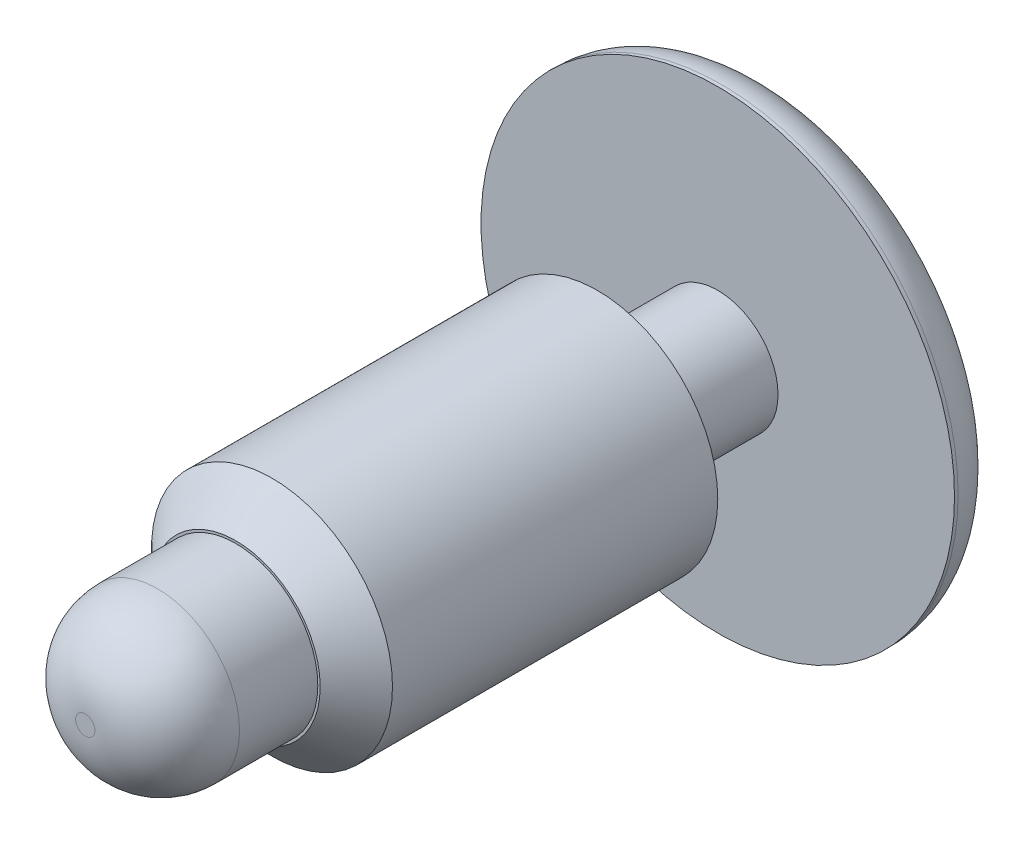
ISO-10303-21;
HEADER;
FILE_DESCRIPTION(('STEP AP214'),'2;1');
FILE_NAME('part.step','',(''),(''),'','','');
FILE_SCHEMA(('AUTOMOTIVE_DESIGN { 1 0 10303 214 1 1 1 1 }'));
ENDSEC;
DATA;
#1=APPLICATION_CONTEXT('core data for automotive mechanical design processes');
#2=APPLICATION_PROTOCOL_DEFINITION('international standard','automotive_design',2000,#1);
#3=PRODUCT_CONTEXT('',#1,'mechanical');
#4=PRODUCT('Part','Part','',(#3));
#5=PRODUCT_RELATED_PRODUCT_CATEGORY('part','',(#4));
#6=PRODUCT_DEFINITION_FORMATION('','',#4);
#7=PRODUCT_DEFINITION_CONTEXT('part definition',#1,'design');
#8=PRODUCT_DEFINITION('design','',#6,#7);
#9=PRODUCT_DEFINITION_SHAPE('','',#8);
#10=(LENGTH_UNIT() NAMED_UNIT(*) SI_UNIT(.MILLI.,.METRE.));
#11=(NAMED_UNIT(*) PLANE_ANGLE_UNIT() SI_UNIT($,.RADIAN.));
#12=(NAMED_UNIT(*) SI_UNIT($,.STERADIAN.) SOLID_ANGLE_UNIT());
#13=UNCERTAINTY_MEASURE_WITH_UNIT(LENGTH_MEASURE(1.E-05),#10,'distance_accuracy_value','');
#14=(GEOMETRIC_REPRESENTATION_CONTEXT(3) GLOBAL_UNCERTAINTY_ASSIGNED_CONTEXT((#13)) GLOBAL_UNIT_ASSIGNED_CONTEXT((#10,
#11,#12)) REPRESENTATION_CONTEXT('',''));
#15=CARTESIAN_POINT('',(0.,0.,0.));
#16=DIRECTION('',(0.,0.,1.));
#17=DIRECTION('',(1.,0.,0.));
#18=AXIS2_PLACEMENT_3D('',#15,#16,#17);
#19=CARTESIAN_POINT('',(0.,0.,11.2522));
#20=DIRECTION('',(0.,0.,1.));
#21=DIRECTION('',(1.,0.,0.));
#22=AXIS2_PLACEMENT_3D('',#19,#20,#21);
#23=PLANE('',#22);
#24=CARTESIAN_POINT('',(0.,0.,11.2522));
#25=DIRECTION('',(0.,0.,1.));
#26=DIRECTION('',(1.,0.,0.));
#27=AXIS2_PLACEMENT_3D('',#24,#25,#26);
#28=CIRCLE('',#27,1.778);
#29=CARTESIAN_POINT('',(1.778,0.,11.2522));
#30=VERTEX_POINT('',#29);
#31=EDGE_CURVE('E46',#30,#30,#28,.T.);
#32=ORIENTED_EDGE('',*,*,#31,.T.);
#33=EDGE_LOOP('',(#32));
#34=FACE_BOUND('',#33,.T.);
#35=CARTESIAN_POINT('',(0.,0.,11.2522));
#36=DIRECTION('',(0.,0.,1.));
#37=DIRECTION('',(1.,0.,0.));
#38=AXIS2_PLACEMENT_3D('',#35,#36,#37);
#39=CIRCLE('',#38,1.7272);
#40=CARTESIAN_POINT('',(1.7272,0.,11.2522));
#41=VERTEX_POINT('',#40);
#42=EDGE_CURVE('E69',#41,#41,#39,.T.);
#43=ORIENTED_EDGE('',*,*,#42,.F.);
#44=EDGE_LOOP('',(#43));
#45=FACE_BOUND('',#44,.T.);
#46=ADVANCED_FACE('F31',(#34,#45),#23,.T.);
#47=CARTESIAN_POINT('',(0.,0.,11.2522));
#48=DIRECTION('',(0.,0.,-1.));
#49=DIRECTION('',(-1.,0.,0.));
#50=AXIS2_PLACEMENT_3D('',#47,#48,#49);
#51=CYLINDRICAL_SURFACE('',#50,1.27);
#52=CARTESIAN_POINT('',(0.,0.,1.0922));
#53=DIRECTION('',(0.,0.,1.));
#54=DIRECTION('',(1.,0.,0.));
#55=AXIS2_PLACEMENT_3D('',#52,#53,#54);
#56=CIRCLE('',#55,1.27);
#57=CARTESIAN_POINT('',(1.27,0.,1.0922));
#58=VERTEX_POINT('',#57);
#59=EDGE_CURVE('E63',#58,#58,#56,.T.);
#60=ORIENTED_EDGE('',*,*,#59,.T.);
#61=EDGE_LOOP('',(#60));
#62=FACE_BOUND('',#61,.T.);
#63=CARTESIAN_POINT('',(0.,0.,3.6322));
#64=DIRECTION('',(0.,0.,1.));
#65=DIRECTION('',(1.,0.,0.));
#66=AXIS2_PLACEMENT_3D('',#63,#64,#65);
#67=CIRCLE('',#66,1.27);
#68=CARTESIAN_POINT('',(1.27,0.,3.6322));
#69=VERTEX_POINT('',#68);
#70=EDGE_CURVE('E57',#69,#69,#67,.T.);
#71=ORIENTED_EDGE('',*,*,#70,.F.);
#72=EDGE_LOOP('',(#71));
#73=FACE_BOUND('',#72,.T.);
#74=ADVANCED_FACE('F76',(#62,#73),#51,.T.);
#75=CARTESIAN_POINT('',(0.,0.,1.0922));
#76=DIRECTION('',(0.,0.,1.));
#77=DIRECTION('',(1.,0.,0.));
#78=AXIS2_PLACEMENT_3D('',#75,#76,#77);
#79=PLANE('',#78);
#80=CARTESIAN_POINT('',(0.,0.,1.0922));
#81=DIRECTION('',(0.,0.,1.));
#82=DIRECTION('',(1.,0.,0.));
#83=AXIS2_PLACEMENT_3D('',#80,#81,#82);
#84=CIRCLE('',#83,4.9911);
#85=CARTESIAN_POINT('',(4.9911,0.,1.0922));
#86=VERTEX_POINT('',#85);
#87=EDGE_CURVE('E60',#86,#86,#84,.T.);
#88=ORIENTED_EDGE('',*,*,#87,.T.);
#89=EDGE_LOOP('',(#88));
#90=FACE_BOUND('',#89,.T.);
#91=ORIENTED_EDGE('',*,*,#59,.F.);
#92=EDGE_LOOP('',(#91));
#93=FACE_BOUND('',#92,.T.);
#94=ADVANCED_FACE('F82',(#90,#93),#79,.T.);
#95=CARTESIAN_POINT('',(0.,0.,1.0922));
#96=DIRECTION('',(0.,0.,-1.));
#97=DIRECTION('',(-1.,0.,0.));
#98=AXIS2_PLACEMENT_3D('',#95,#96,#97);
#99=CYLINDRICAL_SURFACE('',#98,4.9911);
#100=CARTESIAN_POINT('',(0.,0.,1.016));
#101=DIRECTION('',(0.,0.,1.));
#102=DIRECTION('',(1.,0.,0.));
#103=AXIS2_PLACEMENT_3D('',#100,#101,#102);
#104=CIRCLE('',#103,4.9911);
#105=CARTESIAN_POINT('',(4.9911,0.,1.016));
#106=VERTEX_POINT('',#105);
#107=EDGE_CURVE('E38',#106,#106,#104,.T.);
#108=ORIENTED_EDGE('',*,*,#107,.T.);
#109=EDGE_LOOP('',(#108));
#110=FACE_BOUND('',#109,.T.);
#111=ORIENTED_EDGE('',*,*,#87,.F.);
#112=EDGE_LOOP('',(#111));
#113=FACE_BOUND('',#112,.T.);
#114=ADVANCED_FACE('F33',(#110,#113),#99,.T.);
#115=CARTESIAN_POINT('',(0.,0.,0.));
#116=DIRECTION('',(0.,0.,1.));
#117=DIRECTION('',(1.,0.,0.));
#118=AXIS2_PLACEMENT_3D('',#115,#116,#117);
#119=PLANE('',#118);
#120=CARTESIAN_POINT('',(0.,0.,0.));
#121=DIRECTION('',(0.,0.,1.));
#122=DIRECTION('',(1.,0.,0.));
#123=AXIS2_PLACEMENT_3D('',#120,#121,#122);
#124=CIRCLE('',#123,3.9751);
#125=CARTESIAN_POINT('',(3.9751,0.,0.));
#126=VERTEX_POINT('',#125);
#127=EDGE_CURVE('E10',#126,#126,#124,.F.);
#128=ORIENTED_EDGE('',*,*,#127,.T.);
#129=EDGE_LOOP('',(#128));
#130=FACE_BOUND('',#129,.T.);
#131=ADVANCED_FACE('F89',(#130),#119,.F.);
#132=CARTESIAN_POINT('',(0.,0.,3.6322));
#133=DIRECTION('',(0.,0.,1.));
#134=DIRECTION('',(1.,0.,0.));
#135=AXIS2_PLACEMENT_3D('',#132,#133,#134);
#136=PLANE('',#135);
#137=CARTESIAN_POINT('',(0.,0.,3.6322));
#138=DIRECTION('',(0.,0.,1.));
#139=DIRECTION('',(1.,0.,0.));
#140=AXIS2_PLACEMENT_3D('',#137,#138,#139);
#141=CIRCLE('',#140,2.54);
#142=CARTESIAN_POINT('',(2.54,0.,3.6322));
#143=VERTEX_POINT('',#142);
#144=EDGE_CURVE('E66',#143,#143,#141,.T.);
#145=ORIENTED_EDGE('',*,*,#144,.F.);
#146=EDGE_LOOP('',(#145));
#147=FACE_BOUND('',#146,.T.);
#148=ORIENTED_EDGE('',*,*,#70,.T.);
#149=EDGE_LOOP('',(#148));
#150=FACE_BOUND('',#149,.T.);
#151=ADVANCED_FACE('F91',(#147,#150),#136,.F.);
#152=CARTESIAN_POINT('',(0.,0.,3.6322));
#153=DIRECTION('',(0.,0.,1.));
#154=DIRECTION('',(1.,0.,0.));
#155=AXIS2_PLACEMENT_3D('',#152,#153,#154);
#156=CYLINDRICAL_SURFACE('',#155,2.54);
#157=CARTESIAN_POINT('',(0.,0.,10.4902));
#158=DIRECTION('',(0.,0.,1.));
#159=DIRECTION('',(1.,0.,0.));
#160=AXIS2_PLACEMENT_3D('',#157,#158,#159);
#161=CIRCLE('',#160,2.54);
#162=CARTESIAN_POINT('',(2.54,0.,10.4902));
#163=VERTEX_POINT('',#162);
#164=EDGE_CURVE('E42',#163,#163,#161,.F.);
#165=CARTESIAN_POINT('',(2.54,0.,10.4902));
#166=CARTESIAN_POINT('',(2.54,0.,10.4187625));
#167=CARTESIAN_POINT('',(2.54,0.,10.347325));
#168=CARTESIAN_POINT('',(2.54,0.,10.20445));
#169=CARTESIAN_POINT('',(2.54,0.,10.1330125));
#170=CARTESIAN_POINT('',(2.54,0.,9.9901375));
#171=CARTESIAN_POINT('',(2.54,0.,9.9187));
#172=CARTESIAN_POINT('',(2.54,0.,9.775825));
#173=CARTESIAN_POINT('',(2.54,0.,9.7043875));
#174=CARTESIAN_POINT('',(2.54,0.,9.5615125));
#175=CARTESIAN_POINT('',(2.54,0.,9.490075));
#176=CARTESIAN_POINT('',(2.54,0.,9.3472));
#177=CARTESIAN_POINT('',(2.54,0.,9.2757625));
#178=CARTESIAN_POINT('',(2.54,0.,9.1328875));
#179=CARTESIAN_POINT('',(2.54,0.,9.06145));
#180=CARTESIAN_POINT('',(2.54,0.,8.918575));
#181=CARTESIAN_POINT('',(2.54,0.,8.8471375));
#182=CARTESIAN_POINT('',(2.54,0.,8.7042625));
#183=CARTESIAN_POINT('',(2.54,0.,8.632825));
#184=CARTESIAN_POINT('',(2.54,0.,8.48995));
#185=CARTESIAN_POINT('',(2.54,0.,8.4185125));
#186=CARTESIAN_POINT('',(2.54,0.,8.2756375));
#187=CARTESIAN_POINT('',(2.54,0.,8.2042));
#188=CARTESIAN_POINT('',(2.54,0.,8.061325));
#189=CARTESIAN_POINT('',(2.54,0.,7.9898875));
#190=CARTESIAN_POINT('',(2.54,0.,7.8470125));
#191=CARTESIAN_POINT('',(2.54,0.,7.775575));
#192=CARTESIAN_POINT('',(2.54,0.,7.6327));
#193=CARTESIAN_POINT('',(2.54,0.,7.5612625));
#194=CARTESIAN_POINT('',(2.54,0.,7.4183875));
#195=CARTESIAN_POINT('',(2.54,0.,7.34695));
#196=CARTESIAN_POINT('',(2.54,0.,7.204075));
#197=CARTESIAN_POINT('',(2.54,0.,7.1326375));
#198=CARTESIAN_POINT('',(2.54,0.,6.9897625));
#199=CARTESIAN_POINT('',(2.54,0.,6.918325));
#200=CARTESIAN_POINT('',(2.54,0.,6.77545));
#201=CARTESIAN_POINT('',(2.54,0.,6.7040125));
#202=CARTESIAN_POINT('',(2.54,0.,6.5611375));
#203=CARTESIAN_POINT('',(2.54,0.,6.4897));
#204=CARTESIAN_POINT('',(2.54,0.,6.346825));
#205=CARTESIAN_POINT('',(2.54,0.,6.2753875));
#206=CARTESIAN_POINT('',(2.54,0.,6.1325125));
#207=CARTESIAN_POINT('',(2.54,0.,6.061075));
#208=CARTESIAN_POINT('',(2.54,0.,5.9182));
#209=CARTESIAN_POINT('',(2.54,0.,5.8467625));
#210=CARTESIAN_POINT('',(2.54,0.,5.7038875));
#211=CARTESIAN_POINT('',(2.54,0.,5.63245));
#212=CARTESIAN_POINT('',(2.54,0.,5.489575));
#213=CARTESIAN_POINT('',(2.54,0.,5.4181375));
#214=CARTESIAN_POINT('',(2.54,0.,5.2752625));
#215=CARTESIAN_POINT('',(2.54,0.,5.203825));
#216=CARTESIAN_POINT('',(2.54,0.,5.06095));
#217=CARTESIAN_POINT('',(2.54,0.,4.9895125));
#218=CARTESIAN_POINT('',(2.54,0.,4.8466375));
#219=CARTESIAN_POINT('',(2.54,0.,4.7752));
#220=CARTESIAN_POINT('',(2.54,0.,4.632325));
#221=CARTESIAN_POINT('',(2.54,0.,4.5608875));
#222=CARTESIAN_POINT('',(2.54,0.,4.4180125));
#223=CARTESIAN_POINT('',(2.54,0.,4.346575));
#224=CARTESIAN_POINT('',(2.54,0.,4.2037));
#225=CARTESIAN_POINT('',(2.54,0.,4.1322625));
#226=CARTESIAN_POINT('',(2.54,0.,3.9893875));
#227=CARTESIAN_POINT('',(2.54,0.,3.91795));
#228=CARTESIAN_POINT('',(2.54,0.,3.775075));
#229=CARTESIAN_POINT('',(2.54,0.,3.7036375));
#230=CARTESIAN_POINT('',(2.54,0.,3.6322));
#231=B_SPLINE_CURVE_WITH_KNOTS('',3,(#165,#166,#167,#168,#169,#170,#171,#172,#173,#174,#175,
#176,#177,#178,#179,#180,#181,#182,#183,#184,#185,#186,#187,#188,#189,#190,#191,#192,#193,#194,
#195,#196,#197,#198,#199,#200,#201,#202,#203,#204,#205,#206,#207,#208,#209,#210,#211,#212,#213,
#214,#215,#216,#217,#218,#219,#220,#221,#222,#223,#224,#225,#226,#227,#228,#229,#230),
.UNSPECIFIED.,.F.,.F.,(4,2,2,2,2,2,2,2,2,2,2,2,2,2,2,2,2,2,2,2,2,2,2,2,2,2,2,2,2,2,2,2,4),(0.,
0.214312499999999,0.428625,0.642937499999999,0.857249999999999,1.0715625,1.285875,1.5001875,
1.7145,1.9288125,2.143125,2.3574375,2.57175,2.7860625,3.000375,3.2146875,3.429,3.6433125,
3.857625,4.0719375,4.28625,4.5005625,4.714875,4.9291875,5.1435,5.3578125,5.572125,5.7864375,
6.00075,6.2150625,6.42937499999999,6.6436875,6.858),.UNSPECIFIED.);
#232=EDGE_CURVE('BSEAM86',#163,#143,#231,.T.);
#233=ORIENTED_EDGE('',*,*,#164,.T.);
#234=ORIENTED_EDGE('',*,*,#144,.T.);
#235=ORIENTED_EDGE('',*,*,#232,.T.);
#236=ORIENTED_EDGE('',*,*,#232,.F.);
#237=EDGE_LOOP('',(#233,#235,#234,#236));
#238=FACE_BOUND('',#237,.T.);
#239=ADVANCED_FACE('F86',(#238),#156,.T.);
#240=CARTESIAN_POINT('',(0.,0.,14.4272));
#241=DIRECTION('',(0.,0.,-1.));
#242=DIRECTION('',(-1.,0.,0.));
#243=AXIS2_PLACEMENT_3D('',#240,#241,#242);
#244=CYLINDRICAL_SURFACE('',#243,1.7272);
#245=CARTESIAN_POINT('',(0.,0.,12.9032));
#246=DIRECTION('',(0.,0.,1.));
#247=DIRECTION('',(1.,0.,0.));
#248=AXIS2_PLACEMENT_3D('',#245,#246,#247);
#249=CIRCLE('',#248,1.7272);
#250=CARTESIAN_POINT('',(1.7272,0.,12.9032));
#251=VERTEX_POINT('',#250);
#252=EDGE_CURVE('E51',#251,#251,#249,.F.);
#253=ORIENTED_EDGE('',*,*,#252,.T.);
#254=EDGE_LOOP('',(#253));
#255=FACE_BOUND('',#254,.T.);
#256=ORIENTED_EDGE('',*,*,#42,.T.);
#257=EDGE_LOOP('',(#256));
#258=FACE_BOUND('',#257,.T.);
#259=ADVANCED_FACE('F73',(#255,#258),#244,.T.);
#260=CARTESIAN_POINT('',(0.,0.,14.4272));
#261=DIRECTION('',(0.,0.,1.));
#262=DIRECTION('',(1.,0.,0.));
#263=AXIS2_PLACEMENT_3D('',#260,#261,#262);
#264=PLANE('',#263);
#265=CARTESIAN_POINT('',(0.,0.,14.4272));
#266=DIRECTION('',(0.,0.,1.));
#267=DIRECTION('',(1.,0.,0.));
#268=AXIS2_PLACEMENT_3D('',#265,#266,#267);
#269=CIRCLE('',#268,0.2032);
#270=CARTESIAN_POINT('',(0.2032,0.,14.4272));
#271=VERTEX_POINT('',#270);
#272=EDGE_CURVE('E54',#271,#271,#269,.T.);
#273=ORIENTED_EDGE('',*,*,#272,.T.);
#274=EDGE_LOOP('',(#273));
#275=FACE_BOUND('',#274,.T.);
#276=ADVANCED_FACE('F113',(#275),#264,.T.);
#277=CARTESIAN_POINT('',(0.,0.,12.9032));
#278=DIRECTION('',(0.,0.,1.));
#279=DIRECTION('',(1.,0.,0.));
#280=AXIS2_PLACEMENT_3D('',#277,#278,#279);
#281=DEGENERATE_TOROIDAL_SURFACE('',#280,0.2032,1.524,.T.);
#282=ORIENTED_EDGE('',*,*,#252,.F.);
#283=EDGE_LOOP('',(#282));
#284=FACE_BOUND('',#283,.T.);
#285=ORIENTED_EDGE('',*,*,#272,.F.);
#286=EDGE_LOOP('',(#285));
#287=FACE_BOUND('',#286,.T.);
#288=ADVANCED_FACE('F117',(#284,#287),#281,.T.);
#289=CARTESIAN_POINT('',(0.,0.,11.2522));
#290=DIRECTION('',(0.,0.,-1.));
#291=DIRECTION('',(-1.,0.,0.));
#292=AXIS2_PLACEMENT_3D('',#289,#290,#291);
#293=CONICAL_SURFACE('',#292,1.778,0.785398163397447);
#294=ORIENTED_EDGE('',*,*,#164,.F.);
#295=EDGE_LOOP('',(#294));
#296=FACE_BOUND('',#295,.T.);
#297=ORIENTED_EDGE('',*,*,#31,.F.);
#298=EDGE_LOOP('',(#297));
#299=FACE_BOUND('',#298,.T.);
#300=ADVANCED_FACE('F121',(#296,#299),#293,.T.);
#301=CARTESIAN_POINT('',(0.,0.,1.016));
#302=DIRECTION('',(0.,0.,1.));
#303=DIRECTION('',(1.,0.,0.));
#304=AXIS2_PLACEMENT_3D('',#301,#302,#303);
#305=TOROIDAL_SURFACE('',#304,3.9751,1.016);
#306=ORIENTED_EDGE('',*,*,#127,.F.);
#307=EDGE_LOOP('',(#306));
#308=FACE_BOUND('',#307,.T.);
#309=ORIENTED_EDGE('',*,*,#107,.F.);
#310=EDGE_LOOP('',(#309));
#311=FACE_BOUND('',#310,.T.);
#312=ADVANCED_FACE('F125',(#308,#311),#305,.T.);
#313=CLOSED_SHELL('',(#46,#74,#94,#114,#131,#151,#239,#259,#276,#288,#300,#312));
#314=MANIFOLD_SOLID_BREP('B2',#313);
#315=ADVANCED_BREP_SHAPE_REPRESENTATION('',(#18,#314),#14);
#316=SHAPE_DEFINITION_REPRESENTATION(#9,#315);
ENDSEC;
END-ISO-10303-21;
